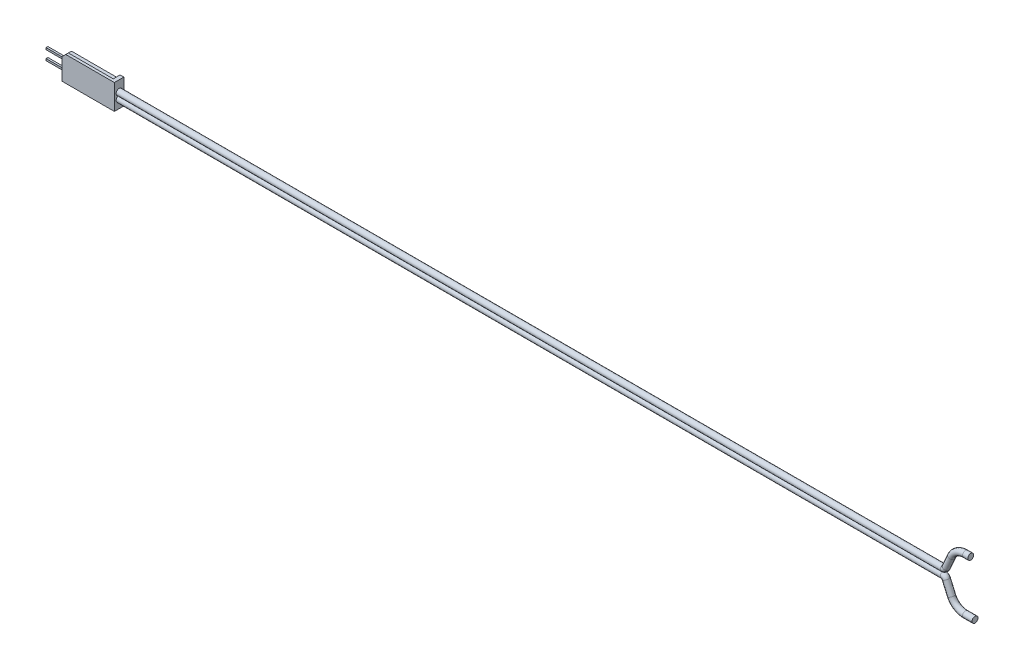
ISO-10303-21;
HEADER;
FILE_DESCRIPTION(('STEP AP214'),'2;1');
FILE_NAME('part.step','',(''),(''),'','','');
FILE_SCHEMA(('AUTOMOTIVE_DESIGN { 1 0 10303 214 1 1 1 1 }'));
ENDSEC;
DATA;
#1=APPLICATION_CONTEXT('core data for automotive mechanical design processes');
#2=APPLICATION_PROTOCOL_DEFINITION('international standard','automotive_design',2000,#1);
#3=PRODUCT_CONTEXT('',#1,'mechanical');
#4=PRODUCT('Part','Part','',(#3));
#5=PRODUCT_RELATED_PRODUCT_CATEGORY('part','',(#4));
#6=PRODUCT_DEFINITION_FORMATION('','',#4);
#7=PRODUCT_DEFINITION_CONTEXT('part definition',#1,'design');
#8=PRODUCT_DEFINITION('design','',#6,#7);
#9=PRODUCT_DEFINITION_SHAPE('','',#8);
#10=(LENGTH_UNIT() NAMED_UNIT(*) SI_UNIT(.MILLI.,.METRE.));
#11=(NAMED_UNIT(*) PLANE_ANGLE_UNIT() SI_UNIT($,.RADIAN.));
#12=(NAMED_UNIT(*) SI_UNIT($,.STERADIAN.) SOLID_ANGLE_UNIT());
#13=UNCERTAINTY_MEASURE_WITH_UNIT(LENGTH_MEASURE(1.E-05),#10,'distance_accuracy_value','');
#14=(GEOMETRIC_REPRESENTATION_CONTEXT(3) GLOBAL_UNCERTAINTY_ASSIGNED_CONTEXT((#13)) GLOBAL_UNIT_ASSIGNED_CONTEXT((#10,
#11,#12)) REPRESENTATION_CONTEXT('',''));
#15=CARTESIAN_POINT('',(0.,0.,0.));
#16=DIRECTION('',(0.,0.,1.));
#17=DIRECTION('',(1.,0.,0.));
#18=AXIS2_PLACEMENT_3D('',#15,#16,#17);
#19=CARTESIAN_POINT('',(234.771596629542,6.99686714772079,8.55189900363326E-13));
#20=DIRECTION('',(1.,0.,0.));
#21=DIRECTION('',(0.,1.,0.));
#22=AXIS2_PLACEMENT_3D('',#19,#20,#21);
#23=PLANE('',#22);
#24=CARTESIAN_POINT('',(234.771596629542,6.99686714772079,8.55189900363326E-13));
#25=DIRECTION('',(1.,0.,0.));
#26=DIRECTION('',(0.,1.,0.));
#27=AXIS2_PLACEMENT_3D('',#24,#25,#26);
#28=CIRCLE('',#27,0.799999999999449);
#29=CARTESIAN_POINT('',(234.771596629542,7.79686714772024,8.55189900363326E-13));
#30=VERTEX_POINT('',#29);
#31=EDGE_CURVE('P0_E18',#30,#30,#28,.F.);
#32=ORIENTED_EDGE('',*,*,#31,.F.);
#33=EDGE_LOOP('',(#32));
#34=FACE_BOUND('',#33,.T.);
#35=ADVANCED_FACE('P0_F15',(#34),#23,.T.);
#36=CARTESIAN_POINT('',(233.37,6.9968671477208,8.55189900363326E-13));
#37=DIRECTION('',(1.,0.,0.));
#38=DIRECTION('',(0.,1.,0.));
#39=AXIS2_PLACEMENT_3D('',#36,#37,#38);
#40=CYLINDRICAL_SURFACE('',#39,0.799999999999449);
#41=CARTESIAN_POINT('',(233.37,6.99686714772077,8.55189900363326E-13));
#42=DIRECTION('',(1.,0.,0.));
#43=DIRECTION('',(0.,1.,0.));
#44=AXIS2_PLACEMENT_3D('',#41,#42,#43);
#45=CIRCLE('',#44,0.799999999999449);
#46=CARTESIAN_POINT('',(233.37,7.79686714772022,8.55189900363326E-13));
#47=VERTEX_POINT('',#46);
#48=EDGE_CURVE('P0_E79',#47,#47,#45,.F.);
#49=ORIENTED_EDGE('',*,*,#48,.F.);
#50=EDGE_LOOP('',(#49));
#51=FACE_BOUND('',#50,.T.);
#52=ORIENTED_EDGE('',*,*,#31,.T.);
#53=EDGE_LOOP('',(#52));
#54=FACE_BOUND('',#53,.T.);
#55=ADVANCED_FACE('P0_F42',(#51,#54),#40,.T.);
#56=CARTESIAN_POINT('',(233.37,2.9207146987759,8.55189900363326E-13));
#57=DIRECTION('',(0.,0.,-1.));
#58=DIRECTION('',(-1.,0.,0.));
#59=AXIS2_PLACEMENT_3D('',#56,#57,#58);
#60=TOROIDAL_SURFACE('',#59,4.07615244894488,0.799999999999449);
#61=ORIENTED_EDGE('',*,*,#48,.T.);
#62=EDGE_LOOP('',(#61));
#63=FACE_BOUND('',#62,.T.);
#64=CARTESIAN_POINT('',(229.636644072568,4.55689082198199,8.55189900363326E-13));
#65=DIRECTION('',(0.401402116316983,0.915901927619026,0.));
#66=DIRECTION('',(-0.915901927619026,0.401402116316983,0.));
#67=AXIS2_PLACEMENT_3D('',#64,#65,#66);
#68=CIRCLE('',#67,0.799999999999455);
#69=CARTESIAN_POINT('',(228.903922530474,4.87801251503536,8.55189900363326E-13));
#70=VERTEX_POINT('',#69);
#71=EDGE_CURVE('P0_E33',#70,#70,#68,.F.);
#72=ORIENTED_EDGE('',*,*,#71,.F.);
#73=EDGE_LOOP('',(#72));
#74=FACE_BOUND('',#73,.T.);
#75=ADVANCED_FACE('P0_F38',(#63,#74),#60,.T.);
#76=CARTESIAN_POINT('',(228.220816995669,1.32631804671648,8.55189900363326E-13));
#77=DIRECTION('',(0.401402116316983,0.915901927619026,0.));
#78=DIRECTION('',(-0.915901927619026,0.401402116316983,0.));
#79=AXIS2_PLACEMENT_3D('',#76,#77,#78);
#80=CYLINDRICAL_SURFACE('',#79,0.799999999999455);
#81=CARTESIAN_POINT('',(228.220816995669,1.32631804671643,8.55189900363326E-13));
#82=DIRECTION('',(0.401402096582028,0.915901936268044,0.));
#83=DIRECTION('',(0.915901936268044,-0.401402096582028,0.));
#84=AXIS2_PLACEMENT_3D('',#81,#82,#83);
#85=CIRCLE('',#84,0.799999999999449);
#86=CARTESIAN_POINT('',(228.953538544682,1.00519636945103,8.55189900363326E-13));
#87=VERTEX_POINT('',#86);
#88=EDGE_CURVE('P0_E27',#87,#87,#85,.F.);
#89=ORIENTED_EDGE('',*,*,#88,.F.);
#90=EDGE_LOOP('',(#89));
#91=FACE_BOUND('',#90,.T.);
#92=ORIENTED_EDGE('',*,*,#71,.T.);
#93=EDGE_LOOP('',(#92));
#94=FACE_BOUND('',#93,.T.);
#95=ADVANCED_FACE('P0_F41',(#91,#94),#80,.T.);
#96=CARTESIAN_POINT('',(7.01,0.800000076,0.));
#97=DIRECTION('',(1.,0.,0.));
#98=DIRECTION('',(0.,1.,0.));
#99=AXIS2_PLACEMENT_3D('',#96,#97,#98);
#100=PLANE('',#99);
#101=CARTESIAN_POINT('',(7.00999999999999,0.800000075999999,9.31962616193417E-13));
#102=DIRECTION('',(1.,0.,0.));
#103=DIRECTION('',(0.,1.,0.));
#104=AXIS2_PLACEMENT_3D('',#101,#102,#103);
#105=CIRCLE('',#104,0.799999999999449);
#106=CARTESIAN_POINT('',(7.00999999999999,1.60000007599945,9.31962616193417E-13));
#107=VERTEX_POINT('',#106);
#108=EDGE_CURVE('P0_E22',#107,#107,#105,.T.);
#109=ORIENTED_EDGE('',*,*,#108,.F.);
#110=EDGE_LOOP('',(#109));
#111=FACE_BOUND('',#110,.T.);
#112=ADVANCED_FACE('P0_F62',(#111),#100,.F.);
#113=CARTESIAN_POINT('',(227.41550904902,1.67925135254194,8.55189900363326E-13));
#114=DIRECTION('',(0.,0.,1.));
#115=DIRECTION('',(1.,0.,0.));
#116=AXIS2_PLACEMENT_3D('',#113,#114,#115);
#117=TOROIDAL_SURFACE('',#116,0.879251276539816,0.799999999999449);
#118=CARTESIAN_POINT('',(227.41550904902,0.800000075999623,5.93540025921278E-13));
#119=DIRECTION('',(1.,0.,0.));
#120=DIRECTION('',(0.,1.,0.));
#121=AXIS2_PLACEMENT_3D('',#118,#119,#120);
#122=CIRCLE('',#121,0.799999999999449);
#123=CARTESIAN_POINT('',(227.41550904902,1.60000007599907,5.93540025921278E-13));
#124=VERTEX_POINT('',#123);
#125=EDGE_CURVE('P0_E10',#124,#124,#122,.F.);
#126=ORIENTED_EDGE('',*,*,#125,.F.);
#127=EDGE_LOOP('',(#126));
#128=FACE_BOUND('',#127,.T.);
#129=ORIENTED_EDGE('',*,*,#88,.T.);
#130=EDGE_LOOP('',(#129));
#131=FACE_BOUND('',#130,.T.);
#132=ADVANCED_FACE('P0_F56',(#128,#131),#117,.T.);
#133=CARTESIAN_POINT('',(6.01,0.800000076,9.33498070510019E-13));
#134=DIRECTION('',(1.,0.,0.));
#135=DIRECTION('',(0.,1.,0.));
#136=AXIS2_PLACEMENT_3D('',#133,#134,#135);
#137=CYLINDRICAL_SURFACE('',#136,0.799999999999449);
#138=ORIENTED_EDGE('',*,*,#108,.T.);
#139=EDGE_LOOP('',(#138));
#140=FACE_BOUND('',#139,.T.);
#141=ORIENTED_EDGE('',*,*,#125,.T.);
#142=EDGE_LOOP('',(#141));
#143=FACE_BOUND('',#142,.T.);
#144=ADVANCED_FACE('P0_F54',(#140,#143),#137,.T.);
#145=CLOSED_SHELL('',(#35,#55,#75,#95,#112,#132,#144));
#146=MANIFOLD_SOLID_BREP('P0_B1',#145);
#147=CARTESIAN_POINT('',(-7.,-1.007199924,-0.25));
#148=DIRECTION('',(0.,0.,-1.));
#149=DIRECTION('',(-1.,0.,0.));
#150=AXIS2_PLACEMENT_3D('',#147,#148,#149);
#151=PLANE('',#150);
#152=DIRECTION('',(1.,0.,0.));
#153=VECTOR('',#152,1.);
#154=CARTESIAN_POINT('',(-7.,-1.507199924,-0.25));
#155=LINE('',#154,#153);
#156=CARTESIAN_POINT('',(-12.3,-1.507199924,-0.25));
#157=VERTEX_POINT('',#156);
#158=CARTESIAN_POINT('',(-7.,-1.507199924,-0.25));
#159=VERTEX_POINT('',#158);
#160=EDGE_CURVE('P1_E128',#157,#159,#155,.T.);
#161=ORIENTED_EDGE('',*,*,#160,.F.);
#162=DIRECTION('',(0.,1.,0.));
#163=VECTOR('',#162,1.);
#164=CARTESIAN_POINT('',(-12.3,-1.007199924,-0.25));
#165=LINE('',#164,#163);
#166=CARTESIAN_POINT('',(-12.3,-1.007199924,-0.25));
#167=VERTEX_POINT('',#166);
#168=EDGE_CURVE('P1_E133',#157,#167,#165,.T.);
#169=ORIENTED_EDGE('',*,*,#168,.T.);
#170=DIRECTION('',(1.,0.,0.));
#171=VECTOR('',#170,1.);
#172=CARTESIAN_POINT('',(-7.,-1.007199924,-0.25));
#173=LINE('',#172,#171);
#174=CARTESIAN_POINT('',(-7.,-1.007199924,-0.25));
#175=VERTEX_POINT('',#174);
#176=EDGE_CURVE('P1_E131',#175,#167,#173,.F.);
#177=ORIENTED_EDGE('',*,*,#176,.F.);
#178=DIRECTION('',(0.,1.,0.));
#179=VECTOR('',#178,1.);
#180=CARTESIAN_POINT('',(-7.,-1.007199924,-0.25));
#181=LINE('',#180,#179);
#182=EDGE_CURVE('P1_E20',#175,#159,#181,.F.);
#183=ORIENTED_EDGE('',*,*,#182,.T.);
#184=EDGE_LOOP('',(#161,#169,#177,#183));
#185=FACE_BOUND('',#184,.T.);
#186=ADVANCED_FACE('P1_F17',(#185),#151,.T.);
#187=CARTESIAN_POINT('',(-7.,1.532800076,-0.25));
#188=DIRECTION('',(0.,0.,-1.));
#189=DIRECTION('',(-1.,0.,0.));
#190=AXIS2_PLACEMENT_3D('',#187,#188,#189);
#191=PLANE('',#190);
#192=DIRECTION('',(1.,0.,0.));
#193=VECTOR('',#192,1.);
#194=CARTESIAN_POINT('',(-7.,1.032800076,-0.25));
#195=LINE('',#194,#193);
#196=CARTESIAN_POINT('',(-12.3,1.032800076,-0.25));
#197=VERTEX_POINT('',#196);
#198=CARTESIAN_POINT('',(-7.,1.032800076,-0.25));
#199=VERTEX_POINT('',#198);
#200=EDGE_CURVE('P1_E166',#197,#199,#195,.T.);
#201=ORIENTED_EDGE('',*,*,#200,.F.);
#202=DIRECTION('',(0.,1.,0.));
#203=VECTOR('',#202,1.);
#204=CARTESIAN_POINT('',(-12.3,1.532800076,-0.25));
#205=LINE('',#204,#203);
#206=CARTESIAN_POINT('',(-12.3,1.532800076,-0.25));
#207=VERTEX_POINT('',#206);
#208=EDGE_CURVE('P1_E147',#197,#207,#205,.T.);
#209=ORIENTED_EDGE('',*,*,#208,.T.);
#210=DIRECTION('',(1.,0.,0.));
#211=VECTOR('',#210,1.);
#212=CARTESIAN_POINT('',(-7.,1.532800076,-0.25));
#213=LINE('',#212,#211);
#214=CARTESIAN_POINT('',(-7.,1.532800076,-0.25));
#215=VERTEX_POINT('',#214);
#216=EDGE_CURVE('P1_E176',#215,#207,#213,.F.);
#217=ORIENTED_EDGE('',*,*,#216,.F.);
#218=DIRECTION('',(0.,1.,0.));
#219=VECTOR('',#218,1.);
#220=CARTESIAN_POINT('',(-7.,1.532800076,-0.25));
#221=LINE('',#220,#219);
#222=EDGE_CURVE('P1_E149',#215,#199,#221,.F.);
#223=ORIENTED_EDGE('',*,*,#222,.T.);
#224=EDGE_LOOP('',(#201,#209,#217,#223));
#225=FACE_BOUND('',#224,.T.);
#226=ADVANCED_FACE('P1_F444',(#225),#191,.T.);
#227=CARTESIAN_POINT('',(-7.,-1.507199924,-0.25));
#228=DIRECTION('',(0.,-1.,0.));
#229=DIRECTION('',(0.,0.,-1.));
#230=AXIS2_PLACEMENT_3D('',#227,#228,#229);
#231=PLANE('',#230);
#232=DIRECTION('',(1.,0.,0.));
#233=VECTOR('',#232,1.);
#234=CARTESIAN_POINT('',(-7.,-1.507199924,0.25));
#235=LINE('',#234,#233);
#236=CARTESIAN_POINT('',(-12.3,-1.507199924,0.25));
#237=VERTEX_POINT('',#236);
#238=CARTESIAN_POINT('',(-7.,-1.507199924,0.25));
#239=VERTEX_POINT('',#238);
#240=EDGE_CURVE('P1_E195',#237,#239,#235,.T.);
#241=ORIENTED_EDGE('',*,*,#240,.F.);
#242=DIRECTION('',(0.,0.,1.));
#243=VECTOR('',#242,1.);
#244=CARTESIAN_POINT('',(-12.3,-1.507199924,-1.27));
#245=LINE('',#244,#243);
#246=EDGE_CURVE('P1_E146',#157,#237,#245,.T.);
#247=ORIENTED_EDGE('',*,*,#246,.F.);
#248=ORIENTED_EDGE('',*,*,#160,.T.);
#249=DIRECTION('',(0.,0.,-1.));
#250=VECTOR('',#249,1.);
#251=CARTESIAN_POINT('',(-7.,-1.507199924,-0.25));
#252=LINE('',#251,#250);
#253=EDGE_CURVE('P1_E135',#159,#239,#252,.F.);
#254=ORIENTED_EDGE('',*,*,#253,.T.);
#255=EDGE_LOOP('',(#241,#247,#248,#254));
#256=FACE_BOUND('',#255,.T.);
#257=ADVANCED_FACE('P1_F144',(#256),#231,.T.);
#258=CARTESIAN_POINT('',(-7.,-1.007199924,0.25));
#259=DIRECTION('',(0.,1.,0.));
#260=DIRECTION('',(0.,0.,1.));
#261=AXIS2_PLACEMENT_3D('',#258,#259,#260);
#262=PLANE('',#261);
#263=ORIENTED_EDGE('',*,*,#176,.T.);
#264=DIRECTION('',(0.,0.,1.));
#265=VECTOR('',#264,1.);
#266=CARTESIAN_POINT('',(-12.3,-1.007199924,-1.27));
#267=LINE('',#266,#265);
#268=CARTESIAN_POINT('',(-12.3,-1.007199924,0.25));
#269=VERTEX_POINT('',#268);
#270=EDGE_CURVE('P1_E158',#269,#167,#267,.F.);
#271=ORIENTED_EDGE('',*,*,#270,.F.);
#272=DIRECTION('',(1.,0.,0.));
#273=VECTOR('',#272,1.);
#274=CARTESIAN_POINT('',(-7.,-1.007199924,0.25));
#275=LINE('',#274,#273);
#276=CARTESIAN_POINT('',(-7.,-1.007199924,0.25));
#277=VERTEX_POINT('',#276);
#278=EDGE_CURVE('P1_E197',#277,#269,#275,.F.);
#279=ORIENTED_EDGE('',*,*,#278,.F.);
#280=DIRECTION('',(0.,0.,1.));
#281=VECTOR('',#280,1.);
#282=CARTESIAN_POINT('',(-7.,-1.007199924,0.25));
#283=LINE('',#282,#281);
#284=EDGE_CURVE('P1_E142',#277,#175,#283,.F.);
#285=ORIENTED_EDGE('',*,*,#284,.T.);
#286=EDGE_LOOP('',(#263,#271,#279,#285));
#287=FACE_BOUND('',#286,.T.);
#288=ADVANCED_FACE('P1_F156',(#287),#262,.T.);
#289=CARTESIAN_POINT('',(-12.3,-1.257199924,-1.27));
#290=DIRECTION('',(-1.,0.,0.));
#291=DIRECTION('',(0.,0.,1.));
#292=AXIS2_PLACEMENT_3D('',#289,#290,#291);
#293=PLANE('',#292);
#294=ORIENTED_EDGE('',*,*,#246,.T.);
#295=DIRECTION('',(0.,1.,0.));
#296=VECTOR('',#295,1.);
#297=CARTESIAN_POINT('',(-12.3,-1.507199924,0.25));
#298=LINE('',#297,#296);
#299=EDGE_CURVE('P1_E163',#269,#237,#298,.F.);
#300=ORIENTED_EDGE('',*,*,#299,.F.);
#301=ORIENTED_EDGE('',*,*,#270,.T.);
#302=ORIENTED_EDGE('',*,*,#168,.F.);
#303=EDGE_LOOP('',(#294,#300,#301,#302));
#304=FACE_BOUND('',#303,.T.);
#305=ADVANCED_FACE('P1_F161',(#304),#293,.T.);
#306=CARTESIAN_POINT('',(-7.,1.032800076,-0.25));
#307=DIRECTION('',(0.,-1.,0.));
#308=DIRECTION('',(0.,0.,-1.));
#309=AXIS2_PLACEMENT_3D('',#306,#307,#308);
#310=PLANE('',#309);
#311=DIRECTION('',(1.,0.,0.));
#312=VECTOR('',#311,1.);
#313=CARTESIAN_POINT('',(-7.,1.032800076,0.25));
#314=LINE('',#313,#312);
#315=CARTESIAN_POINT('',(-12.3,1.032800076,0.25));
#316=VERTEX_POINT('',#315);
#317=CARTESIAN_POINT('',(-7.,1.032800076,0.25));
#318=VERTEX_POINT('',#317);
#319=EDGE_CURVE('P1_E200',#316,#318,#314,.T.);
#320=ORIENTED_EDGE('',*,*,#319,.F.);
#321=DIRECTION('',(0.,0.,1.));
#322=VECTOR('',#321,1.);
#323=CARTESIAN_POINT('',(-12.3,1.032800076,-1.27));
#324=LINE('',#323,#322);
#325=EDGE_CURVE('P1_E182',#197,#316,#324,.T.);
#326=ORIENTED_EDGE('',*,*,#325,.F.);
#327=ORIENTED_EDGE('',*,*,#200,.T.);
#328=DIRECTION('',(0.,0.,-1.));
#329=VECTOR('',#328,1.);
#330=CARTESIAN_POINT('',(-7.,1.032800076,-0.25));
#331=LINE('',#330,#329);
#332=EDGE_CURVE('P1_E171',#199,#318,#331,.F.);
#333=ORIENTED_EDGE('',*,*,#332,.T.);
#334=EDGE_LOOP('',(#320,#326,#327,#333));
#335=FACE_BOUND('',#334,.T.);
#336=ADVANCED_FACE('P1_F413',(#335),#310,.T.);
#337=CARTESIAN_POINT('',(-7.,1.532800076,0.25));
#338=DIRECTION('',(0.,1.,0.));
#339=DIRECTION('',(0.,0.,1.));
#340=AXIS2_PLACEMENT_3D('',#337,#338,#339);
#341=PLANE('',#340);
#342=ORIENTED_EDGE('',*,*,#216,.T.);
#343=DIRECTION('',(0.,0.,1.));
#344=VECTOR('',#343,1.);
#345=CARTESIAN_POINT('',(-12.3,1.532800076,-1.27));
#346=LINE('',#345,#344);
#347=CARTESIAN_POINT('',(-12.3,1.532800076,0.25));
#348=VERTEX_POINT('',#347);
#349=EDGE_CURVE('P1_E179',#348,#207,#346,.F.);
#350=ORIENTED_EDGE('',*,*,#349,.F.);
#351=DIRECTION('',(1.,0.,0.));
#352=VECTOR('',#351,1.);
#353=CARTESIAN_POINT('',(-7.,1.532800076,0.25));
#354=LINE('',#353,#352);
#355=CARTESIAN_POINT('',(-7.,1.532800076,0.25));
#356=VERTEX_POINT('',#355);
#357=EDGE_CURVE('P1_E203',#356,#348,#354,.F.);
#358=ORIENTED_EDGE('',*,*,#357,.F.);
#359=DIRECTION('',(0.,0.,1.));
#360=VECTOR('',#359,1.);
#361=CARTESIAN_POINT('',(-7.,1.532800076,0.25));
#362=LINE('',#361,#360);
#363=EDGE_CURVE('P1_E173',#356,#215,#362,.F.);
#364=ORIENTED_EDGE('',*,*,#363,.T.);
#365=EDGE_LOOP('',(#342,#350,#358,#364));
#366=FACE_BOUND('',#365,.T.);
#367=ADVANCED_FACE('P1_F297',(#366),#341,.T.);
#368=CARTESIAN_POINT('',(-12.3,-1.257199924,-1.27));
#369=DIRECTION('',(-1.,0.,0.));
#370=DIRECTION('',(0.,0.,1.));
#371=AXIS2_PLACEMENT_3D('',#368,#369,#370);
#372=PLANE('',#371);
#373=ORIENTED_EDGE('',*,*,#325,.T.);
#374=DIRECTION('',(0.,1.,0.));
#375=VECTOR('',#374,1.);
#376=CARTESIAN_POINT('',(-12.3,1.032800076,0.25));
#377=LINE('',#376,#375);
#378=EDGE_CURVE('P1_E206',#348,#316,#377,.F.);
#379=ORIENTED_EDGE('',*,*,#378,.F.);
#380=ORIENTED_EDGE('',*,*,#349,.T.);
#381=ORIENTED_EDGE('',*,*,#208,.F.);
#382=EDGE_LOOP('',(#373,#379,#380,#381));
#383=FACE_BOUND('',#382,.T.);
#384=ADVANCED_FACE('P1_F289',(#383),#372,.T.);
#385=CARTESIAN_POINT('',(6.,2.592800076,-2.68421356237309));
#386=DIRECTION('',(1.,0.,0.));
#387=DIRECTION('',(0.,0.,-1.));
#388=AXIS2_PLACEMENT_3D('',#385,#386,#387);
#389=PLANE('',#388);
#390=DIRECTION('',(0.,1.,0.));
#391=VECTOR('',#390,1.);
#392=CARTESIAN_POINT('',(6.,-1.257199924,-1.27));
#393=LINE('',#392,#391);
#394=CARTESIAN_POINT('',(6.,3.592800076,-1.27));
#395=VERTEX_POINT('',#394);
#396=CARTESIAN_POINT('',(6.,2.592800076,-1.27));
#397=VERTEX_POINT('',#396);
#398=EDGE_CURVE('P1_E209',#395,#397,#393,.F.);
#399=ORIENTED_EDGE('',*,*,#398,.T.);
#400=DIRECTION('',(0.,0.,1.));
#401=VECTOR('',#400,1.);
#402=CARTESIAN_POINT('',(6.,2.592800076,-1.27));
#403=LINE('',#402,#401);
#404=CARTESIAN_POINT('',(6.,2.592800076,0.57));
#405=VERTEX_POINT('',#404);
#406=EDGE_CURVE('P1_E192',#405,#397,#403,.F.);
#407=ORIENTED_EDGE('',*,*,#406,.F.);
#408=DIRECTION('',(0.,1.,0.));
#409=VECTOR('',#408,1.);
#410=CARTESIAN_POINT('',(6.,2.592800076,0.57));
#411=LINE('',#410,#409);
#412=CARTESIAN_POINT('',(6.,3.592800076,0.57));
#413=VERTEX_POINT('',#412);
#414=EDGE_CURVE('P1_E185',#413,#405,#411,.F.);
#415=ORIENTED_EDGE('',*,*,#414,.F.);
#416=DIRECTION('',(0.,0.,1.));
#417=VECTOR('',#416,1.);
#418=CARTESIAN_POINT('',(6.,3.592800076,0.47));
#419=LINE('',#418,#417);
#420=EDGE_CURVE('P1_E213',#395,#413,#419,.T.);
#421=ORIENTED_EDGE('',*,*,#420,.F.);
#422=EDGE_LOOP('',(#399,#407,#415,#421));
#423=FACE_BOUND('',#422,.T.);
#424=ADVANCED_FACE('P1_F287',(#423),#389,.F.);
#425=CARTESIAN_POINT('',(6.,2.592800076,0.57));
#426=DIRECTION('',(0.,0.,-1.));
#427=DIRECTION('',(-1.,0.,0.));
#428=AXIS2_PLACEMENT_3D('',#425,#426,#427);
#429=PLANE('',#428);
#430=DIRECTION('',(0.707106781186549,0.707106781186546,0.));
#431=VECTOR('',#430,1.);
#432=CARTESIAN_POINT('',(-7.,2.592800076,0.57));
#433=LINE('',#432,#431);
#434=CARTESIAN_POINT('',(-7.00000000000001,2.592800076,0.57));
#435=VERTEX_POINT('',#434);
#436=CARTESIAN_POINT('',(-6.,3.592800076,0.57));
#437=VERTEX_POINT('',#436);
#438=EDGE_CURVE('P1_E187',#435,#437,#433,.T.);
#439=ORIENTED_EDGE('',*,*,#438,.T.);
#440=DIRECTION('',(1.,0.,0.));
#441=VECTOR('',#440,1.);
#442=CARTESIAN_POINT('',(-7.,3.592800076,0.57));
#443=LINE('',#442,#441);
#444=EDGE_CURVE('P1_E216',#413,#437,#443,.F.);
#445=ORIENTED_EDGE('',*,*,#444,.F.);
#446=ORIENTED_EDGE('',*,*,#414,.T.);
#447=DIRECTION('',(1.,0.,0.));
#448=VECTOR('',#447,1.);
#449=CARTESIAN_POINT('',(7.,2.592800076,0.57));
#450=LINE('',#449,#448);
#451=EDGE_CURVE('P1_E189',#435,#405,#450,.T.);
#452=ORIENTED_EDGE('',*,*,#451,.F.);
#453=EDGE_LOOP('',(#439,#445,#446,#452));
#454=FACE_BOUND('',#453,.T.);
#455=ADVANCED_FACE('P1_F282',(#454),#429,.T.);
#456=CARTESIAN_POINT('',(7.,2.592800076,-1.27));
#457=DIRECTION('',(0.,1.,0.));
#458=DIRECTION('',(0.,0.,1.));
#459=AXIS2_PLACEMENT_3D('',#456,#457,#458);
#460=PLANE('',#459);
#461=ORIENTED_EDGE('',*,*,#406,.T.);
#462=DIRECTION('',(1.,0.,0.));
#463=VECTOR('',#462,1.);
#464=CARTESIAN_POINT('',(0.,2.592800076,-1.27));
#465=LINE('',#464,#463);
#466=CARTESIAN_POINT('',(-7.,2.592800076,-1.27));
#467=VERTEX_POINT('',#466);
#468=EDGE_CURVE('P1_E211',#397,#467,#465,.F.);
#469=ORIENTED_EDGE('',*,*,#468,.T.);
#470=DIRECTION('',(0.,0.,1.));
#471=VECTOR('',#470,1.);
#472=CARTESIAN_POINT('',(-7.,2.592800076,-1.27));
#473=LINE('',#472,#471);
#474=EDGE_CURVE('P1_E227',#435,#467,#473,.F.);
#475=ORIENTED_EDGE('',*,*,#474,.F.);
#476=ORIENTED_EDGE('',*,*,#451,.T.);
#477=EDGE_LOOP('',(#461,#469,#475,#476));
#478=FACE_BOUND('',#477,.T.);
#479=ADVANCED_FACE('P1_F285',(#478),#460,.T.);
#480=CARTESIAN_POINT('',(-7.,-1.507199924,0.25));
#481=DIRECTION('',(0.,0.,1.));
#482=DIRECTION('',(1.,0.,0.));
#483=AXIS2_PLACEMENT_3D('',#480,#481,#482);
#484=PLANE('',#483);
#485=ORIENTED_EDGE('',*,*,#278,.T.);
#486=ORIENTED_EDGE('',*,*,#299,.T.);
#487=ORIENTED_EDGE('',*,*,#240,.T.);
#488=DIRECTION('',(0.,1.,0.));
#489=VECTOR('',#488,1.);
#490=CARTESIAN_POINT('',(-7.,2.592800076,0.25));
#491=LINE('',#490,#489);
#492=EDGE_CURVE('P1_E139',#277,#239,#491,.F.);
#493=ORIENTED_EDGE('',*,*,#492,.F.);
#494=EDGE_LOOP('',(#485,#486,#487,#493));
#495=FACE_BOUND('',#494,.T.);
#496=ADVANCED_FACE('P1_F321',(#495),#484,.T.);
#497=CARTESIAN_POINT('',(-7.,1.032800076,0.25));
#498=DIRECTION('',(0.,0.,1.));
#499=DIRECTION('',(1.,0.,0.));
#500=AXIS2_PLACEMENT_3D('',#497,#498,#499);
#501=PLANE('',#500);
#502=ORIENTED_EDGE('',*,*,#357,.T.);
#503=ORIENTED_EDGE('',*,*,#378,.T.);
#504=ORIENTED_EDGE('',*,*,#319,.T.);
#505=DIRECTION('',(0.,1.,0.));
#506=VECTOR('',#505,1.);
#507=CARTESIAN_POINT('',(-7.,2.592800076,0.25));
#508=LINE('',#507,#506);
#509=EDGE_CURVE('P1_E233',#356,#318,#508,.F.);
#510=ORIENTED_EDGE('',*,*,#509,.F.);
#511=EDGE_LOOP('',(#502,#503,#504,#510));
#512=FACE_BOUND('',#511,.T.);
#513=ADVANCED_FACE('P1_F318',(#512),#501,.T.);
#514=CARTESIAN_POINT('',(0.,-1.257199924,-1.27));
#515=DIRECTION('',(0.,0.,1.));
#516=DIRECTION('',(1.,0.,0.));
#517=AXIS2_PLACEMENT_3D('',#514,#515,#516);
#518=PLANE('',#517);
#519=DIRECTION('',(1.,0.,0.));
#520=VECTOR('',#519,1.);
#521=CARTESIAN_POINT('',(156.887568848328,-3.107199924,-1.27));
#522=LINE('',#521,#520);
#523=CARTESIAN_POINT('',(7.,-3.107199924,-1.27));
#524=VERTEX_POINT('',#523);
#525=CARTESIAN_POINT('',(-7.,-3.107199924,-1.27));
#526=VERTEX_POINT('',#525);
#527=EDGE_CURVE('P1_E238',#524,#526,#522,.F.);
#528=ORIENTED_EDGE('',*,*,#527,.T.);
#529=DIRECTION('',(0.,1.,0.));
#530=VECTOR('',#529,1.);
#531=CARTESIAN_POINT('',(-7.,2.592800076,-1.27));
#532=LINE('',#531,#530);
#533=EDGE_CURVE('P1_E230',#467,#526,#532,.F.);
#534=ORIENTED_EDGE('',*,*,#533,.F.);
#535=ORIENTED_EDGE('',*,*,#468,.F.);
#536=ORIENTED_EDGE('',*,*,#398,.F.);
#537=DIRECTION('',(1.,0.,0.));
#538=VECTOR('',#537,1.);
#539=CARTESIAN_POINT('',(-7.,3.592800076,-1.27));
#540=LINE('',#539,#538);
#541=CARTESIAN_POINT('',(7.,3.592800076,-1.27));
#542=VERTEX_POINT('',#541);
#543=EDGE_CURVE('P1_E219',#542,#395,#540,.F.);
#544=ORIENTED_EDGE('',*,*,#543,.F.);
#545=DIRECTION('',(0.,1.,0.));
#546=VECTOR('',#545,1.);
#547=CARTESIAN_POINT('',(7.,-5.107199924,-1.27));
#548=LINE('',#547,#546);
#549=EDGE_CURVE('P1_E242',#524,#542,#548,.T.);
#550=ORIENTED_EDGE('',*,*,#549,.F.);
#551=EDGE_LOOP('',(#528,#534,#535,#536,#544,#550));
#552=FACE_BOUND('',#551,.T.);
#553=ADVANCED_FACE('P1_F268',(#552),#518,.F.);
#554=CARTESIAN_POINT('',(-7.,3.592800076,0.47));
#555=DIRECTION('',(0.,1.,0.));
#556=DIRECTION('',(0.,0.,1.));
#557=AXIS2_PLACEMENT_3D('',#554,#555,#556);
#558=PLANE('',#557);
#559=DIRECTION('',(0.,0.,-1.));
#560=VECTOR('',#559,1.);
#561=CARTESIAN_POINT('',(7.,3.592800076,-1.27));
#562=LINE('',#561,#560);
#563=CARTESIAN_POINT('',(7.,3.592800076,1.27));
#564=VERTEX_POINT('',#563);
#565=EDGE_CURVE('P1_E245',#542,#564,#562,.F.);
#566=ORIENTED_EDGE('',*,*,#565,.F.);
#567=ORIENTED_EDGE('',*,*,#543,.T.);
#568=ORIENTED_EDGE('',*,*,#420,.T.);
#569=ORIENTED_EDGE('',*,*,#444,.T.);
#570=DIRECTION('',(0.,0.,1.));
#571=VECTOR('',#570,1.);
#572=CARTESIAN_POINT('',(-6.,3.592800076,-1.27));
#573=LINE('',#572,#571);
#574=CARTESIAN_POINT('',(-6.,3.592800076,1.27));
#575=VERTEX_POINT('',#574);
#576=EDGE_CURVE('P1_E222',#437,#575,#573,.T.);
#577=ORIENTED_EDGE('',*,*,#576,.T.);
#578=DIRECTION('',(1.,0.,0.));
#579=VECTOR('',#578,1.);
#580=CARTESIAN_POINT('',(0.,3.592800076,1.27));
#581=LINE('',#580,#579);
#582=EDGE_CURVE('P1_E248',#564,#575,#581,.F.);
#583=ORIENTED_EDGE('',*,*,#582,.F.);
#584=EDGE_LOOP('',(#566,#567,#568,#569,#577,#583));
#585=FACE_BOUND('',#584,.T.);
#586=ADVANCED_FACE('P1_F274',(#585),#558,.T.);
#587=CARTESIAN_POINT('',(-7.,2.592800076,-1.27));
#588=DIRECTION('',(0.707106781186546,-0.707106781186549,0.));
#589=DIRECTION('',(0.707106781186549,0.707106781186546,0.));
#590=AXIS2_PLACEMENT_3D('',#587,#588,#589);
#591=PLANE('',#590);
#592=ORIENTED_EDGE('',*,*,#438,.F.);
#593=DIRECTION('',(0.,0.,1.));
#594=VECTOR('',#593,1.);
#595=CARTESIAN_POINT('',(-7.,2.592800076,-1.27));
#596=LINE('',#595,#594);
#597=CARTESIAN_POINT('',(-7.,2.592800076,1.27));
#598=VERTEX_POINT('',#597);
#599=EDGE_CURVE('P1_E224',#598,#435,#596,.F.);
#600=ORIENTED_EDGE('',*,*,#599,.F.);
#601=DIRECTION('',(-0.707106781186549,-0.707106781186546,0.));
#602=VECTOR('',#601,1.);
#603=CARTESIAN_POINT('',(-6.,3.592800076,1.27));
#604=LINE('',#603,#602);
#605=EDGE_CURVE('P1_E251',#575,#598,#604,.T.);
#606=ORIENTED_EDGE('',*,*,#605,.F.);
#607=ORIENTED_EDGE('',*,*,#576,.F.);
#608=EDGE_LOOP('',(#592,#600,#606,#607));
#609=FACE_BOUND('',#608,.T.);
#610=ADVANCED_FACE('P1_F278',(#609),#591,.F.);
#611=CARTESIAN_POINT('',(-7.,2.592800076,-1.27));
#612=DIRECTION('',(-1.,0.,0.));
#613=DIRECTION('',(0.,0.,1.));
#614=AXIS2_PLACEMENT_3D('',#611,#612,#613);
#615=PLANE('',#614);
#616=ORIENTED_EDGE('',*,*,#363,.F.);
#617=ORIENTED_EDGE('',*,*,#509,.T.);
#618=ORIENTED_EDGE('',*,*,#332,.F.);
#619=ORIENTED_EDGE('',*,*,#222,.F.);
#620=EDGE_LOOP('',(#616,#617,#618,#619));
#621=FACE_BOUND('',#620,.T.);
#622=ORIENTED_EDGE('',*,*,#284,.F.);
#623=ORIENTED_EDGE('',*,*,#492,.T.);
#624=ORIENTED_EDGE('',*,*,#253,.F.);
#625=ORIENTED_EDGE('',*,*,#182,.F.);
#626=EDGE_LOOP('',(#622,#623,#624,#625));
#627=FACE_BOUND('',#626,.T.);
#628=ORIENTED_EDGE('',*,*,#533,.T.);
#629=DIRECTION('',(0.,0.,1.));
#630=VECTOR('',#629,1.);
#631=CARTESIAN_POINT('',(-7.00000000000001,-3.107199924,1.27));
#632=LINE('',#631,#630);
#633=CARTESIAN_POINT('',(-7.,-3.107199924,1.27));
#634=VERTEX_POINT('',#633);
#635=EDGE_CURVE('P1_E236',#526,#634,#632,.T.);
#636=ORIENTED_EDGE('',*,*,#635,.T.);
#637=DIRECTION('',(0.,1.,0.));
#638=VECTOR('',#637,1.);
#639=CARTESIAN_POINT('',(-7.,-1.257199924,1.27));
#640=LINE('',#639,#638);
#641=EDGE_CURVE('P1_E254',#598,#634,#640,.F.);
#642=ORIENTED_EDGE('',*,*,#641,.F.);
#643=ORIENTED_EDGE('',*,*,#599,.T.);
#644=ORIENTED_EDGE('',*,*,#474,.T.);
#645=EDGE_LOOP('',(#628,#636,#642,#643,#644));
#646=FACE_BOUND('',#645,.T.);
#647=ADVANCED_FACE('P1_F136',(#621,#627,#646),#615,.T.);
#648=CARTESIAN_POINT('',(156.887568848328,-3.107199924,1.27));
#649=DIRECTION('',(0.,1.,0.));
#650=DIRECTION('',(0.,0.,1.));
#651=AXIS2_PLACEMENT_3D('',#648,#649,#650);
#652=PLANE('',#651);
#653=DIRECTION('',(0.,0.,-1.));
#654=VECTOR('',#653,1.);
#655=CARTESIAN_POINT('',(7.,-3.107199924,-1.27));
#656=LINE('',#655,#654);
#657=CARTESIAN_POINT('',(7.,-3.107199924,1.27));
#658=VERTEX_POINT('',#657);
#659=EDGE_CURVE('P1_E35',#658,#524,#656,.T.);
#660=ORIENTED_EDGE('',*,*,#659,.F.);
#661=DIRECTION('',(1.,0.,0.));
#662=VECTOR('',#661,1.);
#663=CARTESIAN_POINT('',(0.,-3.107199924,1.27));
#664=LINE('',#663,#662);
#665=EDGE_CURVE('P1_E26',#634,#658,#664,.T.);
#666=ORIENTED_EDGE('',*,*,#665,.F.);
#667=ORIENTED_EDGE('',*,*,#635,.F.);
#668=ORIENTED_EDGE('',*,*,#527,.F.);
#669=EDGE_LOOP('',(#660,#666,#667,#668));
#670=FACE_BOUND('',#669,.T.);
#671=ADVANCED_FACE('P1_F262',(#670),#652,.F.);
#672=CARTESIAN_POINT('',(7.,-5.107199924,-1.27));
#673=DIRECTION('',(1.,0.,0.));
#674=DIRECTION('',(0.,0.,-1.));
#675=AXIS2_PLACEMENT_3D('',#672,#673,#674);
#676=PLANE('',#675);
#677=ORIENTED_EDGE('',*,*,#565,.T.);
#678=DIRECTION('',(0.,1.,0.));
#679=VECTOR('',#678,1.);
#680=CARTESIAN_POINT('',(7.,-1.257199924,1.27));
#681=LINE('',#680,#679);
#682=EDGE_CURVE('P1_E11',#658,#564,#681,.T.);
#683=ORIENTED_EDGE('',*,*,#682,.F.);
#684=ORIENTED_EDGE('',*,*,#659,.T.);
#685=ORIENTED_EDGE('',*,*,#549,.T.);
#686=EDGE_LOOP('',(#677,#683,#684,#685));
#687=FACE_BOUND('',#686,.T.);
#688=ADVANCED_FACE('P1_F272',(#687),#676,.T.);
#689=CARTESIAN_POINT('',(0.,-1.257199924,1.27));
#690=DIRECTION('',(0.,0.,1.));
#691=DIRECTION('',(1.,0.,0.));
#692=AXIS2_PLACEMENT_3D('',#689,#690,#691);
#693=PLANE('',#692);
#694=ORIENTED_EDGE('',*,*,#665,.T.);
#695=ORIENTED_EDGE('',*,*,#682,.T.);
#696=ORIENTED_EDGE('',*,*,#582,.T.);
#697=ORIENTED_EDGE('',*,*,#605,.T.);
#698=ORIENTED_EDGE('',*,*,#641,.T.);
#699=EDGE_LOOP('',(#694,#695,#696,#697,#698));
#700=FACE_BOUND('',#699,.T.);
#701=ADVANCED_FACE('P1_F259',(#700),#693,.T.);
#702=CLOSED_SHELL('',(#186,#226,#257,#288,#305,#336,#367,#384,#424,#455,#479,#496,#513,#553,
#586,#610,#647,#671,#688,#701));
#703=MANIFOLD_SOLID_BREP('P1_B1',#702);
#704=CARTESIAN_POINT('',(235.91,-6.99686707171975,0.));
#705=DIRECTION('',(1.,0.,0.));
#706=DIRECTION('',(0.,1.,0.));
#707=AXIS2_PLACEMENT_3D('',#704,#705,#706);
#708=PLANE('',#707);
#709=CARTESIAN_POINT('',(235.91,-6.99686707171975,0.));
#710=DIRECTION('',(1.,0.,0.));
#711=DIRECTION('',(0.,1.,0.));
#712=AXIS2_PLACEMENT_3D('',#709,#710,#711);
#713=CIRCLE('',#712,0.800000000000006);
#714=CARTESIAN_POINT('',(235.91,-6.19686707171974,0.));
#715=VERTEX_POINT('',#714);
#716=EDGE_CURVE('P2_E18',#715,#715,#713,.F.);
#717=ORIENTED_EDGE('',*,*,#716,.F.);
#718=EDGE_LOOP('',(#717));
#719=FACE_BOUND('',#718,.T.);
#720=ADVANCED_FACE('P2_F15',(#719),#708,.T.);
#721=CARTESIAN_POINT('',(233.37,-6.99686707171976,0.));
#722=DIRECTION('',(1.,0.,0.));
#723=DIRECTION('',(0.,1.,0.));
#724=AXIS2_PLACEMENT_3D('',#721,#722,#723);
#725=CYLINDRICAL_SURFACE('',#724,0.800000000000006);
#726=CARTESIAN_POINT('',(233.37,-6.99686707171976,0.));
#727=DIRECTION('',(1.,0.,0.));
#728=DIRECTION('',(0.,-1.,0.));
#729=AXIS2_PLACEMENT_3D('',#726,#727,#728);
#730=CIRCLE('',#729,0.800000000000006);
#731=CARTESIAN_POINT('',(233.37,-7.79686707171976,0.));
#732=VERTEX_POINT('',#731);
#733=EDGE_CURVE('P2_E34',#732,#732,#730,.F.);
#734=ORIENTED_EDGE('',*,*,#733,.F.);
#735=EDGE_LOOP('',(#734));
#736=FACE_BOUND('',#735,.T.);
#737=ORIENTED_EDGE('',*,*,#716,.T.);
#738=EDGE_LOOP('',(#737));
#739=FACE_BOUND('',#738,.T.);
#740=ADVANCED_FACE('P2_F43',(#736,#739),#725,.T.);
#741=CARTESIAN_POINT('',(233.37,-2.9207146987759,0.));
#742=DIRECTION('',(0.,0.,1.));
#743=DIRECTION('',(1.,0.,0.));
#744=AXIS2_PLACEMENT_3D('',#741,#742,#743);
#745=TOROIDAL_SURFACE('',#744,4.07615237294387,0.800000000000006);
#746=CARTESIAN_POINT('',(229.636644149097,-4.55689080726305,0.));
#747=DIRECTION('',(0.401402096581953,-0.915901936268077,0.));
#748=DIRECTION('',(0.915901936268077,0.401402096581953,0.));
#749=AXIS2_PLACEMENT_3D('',#746,#747,#748);
#750=CIRCLE('',#749,0.800000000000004);
#751=CARTESIAN_POINT('',(230.369365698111,-4.23576912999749,0.));
#752=VERTEX_POINT('',#751);
#753=EDGE_CURVE('P2_E31',#752,#752,#750,.F.);
#754=ORIENTED_EDGE('',*,*,#753,.F.);
#755=EDGE_LOOP('',(#754));
#756=FACE_BOUND('',#755,.T.);
#757=ORIENTED_EDGE('',*,*,#733,.T.);
#758=EDGE_LOOP('',(#757));
#759=FACE_BOUND('',#758,.T.);
#760=ADVANCED_FACE('P2_F39',(#756,#759),#745,.T.);
#761=CARTESIAN_POINT('',(228.220817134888,-1.32631798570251,0.));
#762=DIRECTION('',(0.401402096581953,-0.915901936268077,0.));
#763=DIRECTION('',(0.915901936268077,0.401402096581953,0.));
#764=AXIS2_PLACEMENT_3D('',#761,#762,#763);
#765=CYLINDRICAL_SURFACE('',#764,0.800000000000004);
#766=CARTESIAN_POINT('',(228.220817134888,-1.32631798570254,0.));
#767=DIRECTION('',(0.401402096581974,-0.915901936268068,0.));
#768=DIRECTION('',(0.915901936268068,0.401402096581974,0.));
#769=AXIS2_PLACEMENT_3D('',#766,#767,#768);
#770=CIRCLE('',#769,0.800000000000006);
#771=CARTESIAN_POINT('',(228.953538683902,-1.00519630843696,0.));
#772=VERTEX_POINT('',#771);
#773=EDGE_CURVE('P2_E27',#772,#772,#770,.F.);
#774=ORIENTED_EDGE('',*,*,#773,.F.);
#775=EDGE_LOOP('',(#774));
#776=FACE_BOUND('',#775,.T.);
#777=ORIENTED_EDGE('',*,*,#753,.T.);
#778=EDGE_LOOP('',(#777));
#779=FACE_BOUND('',#778,.T.);
#780=ADVANCED_FACE('P2_F42',(#776,#779),#765,.T.);
#781=CARTESIAN_POINT('',(7.01,-0.799999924,0.));
#782=DIRECTION('',(1.,0.,0.));
#783=DIRECTION('',(0.,0.,-1.));
#784=AXIS2_PLACEMENT_3D('',#781,#782,#783);
#785=PLANE('',#784);
#786=CARTESIAN_POINT('',(7.01,-0.799999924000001,0.));
#787=DIRECTION('',(1.,0.,0.));
#788=DIRECTION('',(0.,1.,0.));
#789=AXIS2_PLACEMENT_3D('',#786,#787,#788);
#790=CIRCLE('',#789,0.800000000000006);
#791=CARTESIAN_POINT('',(7.01,7.6000004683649E-08,0.));
#792=VERTEX_POINT('',#791);
#793=EDGE_CURVE('P2_E22',#792,#792,#790,.T.);
#794=ORIENTED_EDGE('',*,*,#793,.F.);
#795=EDGE_LOOP('',(#794));
#796=FACE_BOUND('',#795,.T.);
#797=ADVANCED_FACE('P2_F63',(#796),#785,.F.);
#798=CARTESIAN_POINT('',(227.41550904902,-1.67925135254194,0.));
#799=DIRECTION('',(0.,0.,-1.));
#800=DIRECTION('',(-1.,0.,0.));
#801=AXIS2_PLACEMENT_3D('',#798,#799,#800);
#802=TOROIDAL_SURFACE('',#801,0.879251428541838,0.800000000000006);
#803=ORIENTED_EDGE('',*,*,#773,.T.);
#804=EDGE_LOOP('',(#803));
#805=FACE_BOUND('',#804,.T.);
#806=CARTESIAN_POINT('',(227.41550904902,-0.799999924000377,-3.17731900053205E-13));
#807=DIRECTION('',(1.,0.,0.));
#808=DIRECTION('',(0.,1.,0.));
#809=AXIS2_PLACEMENT_3D('',#806,#807,#808);
#810=CIRCLE('',#809,0.800000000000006);
#811=CARTESIAN_POINT('',(227.41550904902,7.59996287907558E-08,-3.17731900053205E-13));
#812=VERTEX_POINT('',#811);
#813=EDGE_CURVE('P2_E10',#812,#812,#810,.F.);
#814=ORIENTED_EDGE('',*,*,#813,.F.);
#815=EDGE_LOOP('',(#814));
#816=FACE_BOUND('',#815,.T.);
#817=ADVANCED_FACE('P2_F57',(#805,#816),#802,.T.);
#818=CARTESIAN_POINT('',(6.01,-0.799999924,0.));
#819=DIRECTION('',(1.,0.,0.));
#820=DIRECTION('',(0.,1.,0.));
#821=AXIS2_PLACEMENT_3D('',#818,#819,#820);
#822=CYLINDRICAL_SURFACE('',#821,0.800000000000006);
#823=ORIENTED_EDGE('',*,*,#793,.T.);
#824=EDGE_LOOP('',(#823));
#825=FACE_BOUND('',#824,.T.);
#826=ORIENTED_EDGE('',*,*,#813,.T.);
#827=EDGE_LOOP('',(#826));
#828=FACE_BOUND('',#827,.T.);
#829=ADVANCED_FACE('P2_F55',(#825,#828),#822,.T.);
#830=CLOSED_SHELL('',(#720,#740,#760,#780,#797,#817,#829));
#831=MANIFOLD_SOLID_BREP('P2_B1',#830);
#832=ADVANCED_BREP_SHAPE_REPRESENTATION('',(#18,#146,#703,#831),#14);
#833=SHAPE_DEFINITION_REPRESENTATION(#9,#832);
ENDSEC;
END-ISO-10303-21;
